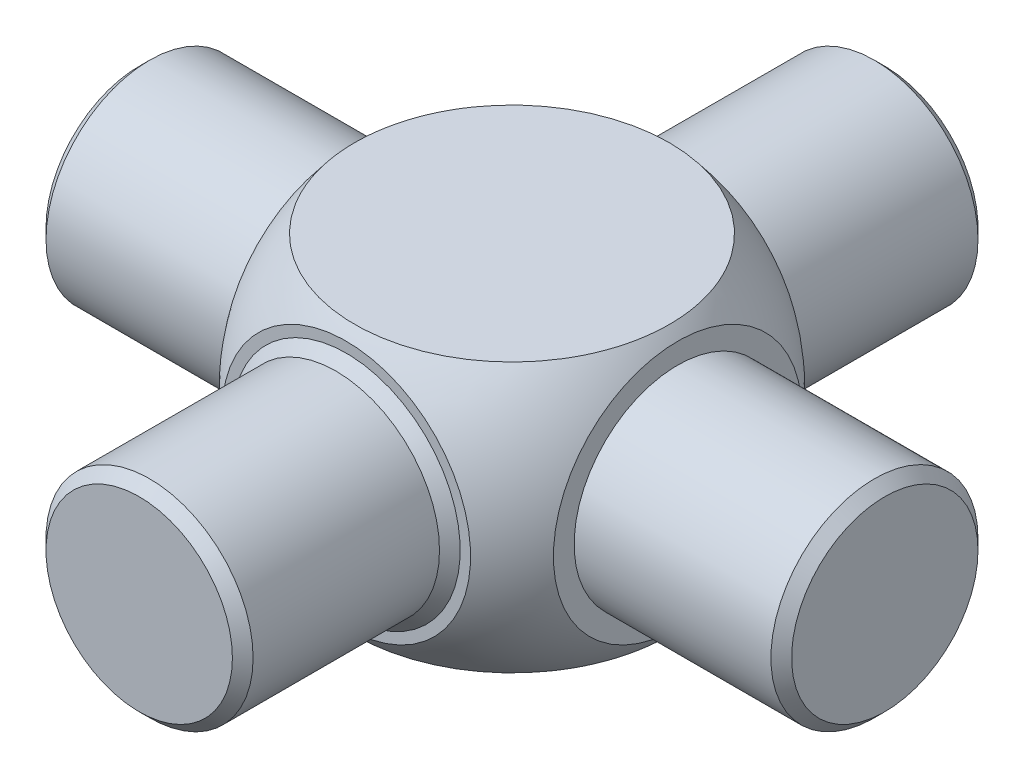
from build123d import *

# Parameters (mm, degrees)
ESQUISSE2_W             = 18
ESQUISSE2_H             = 4.5
ENL_V_MAT_EXTRU_1_DEPTH = 12.5
ESQUISSE3_W             = 18
ESQUISSE3_H             = 3
ENL_V_MAT_EXTRU_2_DEPTH = 12.5
ESQUISSE4_W             = 5
ESQUISSE4_H             = 36
CHANFREIN1_SIZE         = 0.5


with BuildPart() as part:
    # Esquisse1 → Base-R_volution (revolve)
    with BuildSketch(Plane.XY, mode=Mode.PRIVATE) as base_r_volution_sk:
        with BuildLine():
            Line((18, 0), (-18, 0))
            Line((-18, 0), (-18, 5))
            Line((-18, 5), (-8, 5))
            Line((-8, 5), (-8, 6))
            ThreePointArc((-8, 6), (0, 10), (8, 6))
            Line((8, 6), (8, 5))
            Line((8, 5), (18, 5))
            Line((18, 5), (18, 0))
        make_face()
    revolve(base_r_volution_sk.sketch.rotate(Axis((0, 0, 0), (-1, 0, 0)), 90), axis=Axis((0, 0, 0), (-1, 0, 0)))

    # Esquisse2 → Enl_v. mat.-Extru.1 (cut, symmetric)
    with BuildSketch(Plane.XY):
        with Locations((0, 8.75)):
            Rectangle(ESQUISSE2_W, ESQUISSE2_H)
        with Locations((0, -8.75)):
            Rectangle(ESQUISSE2_W, ESQUISSE2_H)
    extrude(amount=ENL_V_MAT_EXTRU_1_DEPTH, both=True, mode=Mode.SUBTRACT)

    # Esquisse3 → Enl_v. mat.-Extru.2 (cut, symmetric)
    with BuildSketch(Plane(origin=(0, 0, 0), x_dir=(1, 0, 0), z_dir=(0, 1, 0))):
        with Locations((0, 9.5)):
            Rectangle(ESQUISSE3_W, ESQUISSE3_H)
        with Locations((0, -9.5)):
            Rectangle(ESQUISSE3_W, ESQUISSE3_H)
    extrude(amount=ENL_V_MAT_EXTRU_2_DEPTH, both=True, mode=Mode.SUBTRACT)

    # Esquisse4 → Boss.-R_vol.1 (revolve)
    with BuildSketch(Plane(origin=(0, 0, 0), x_dir=(1, 0, 0), z_dir=(0, 1, 0))):
        with Locations((2.5, 0)):
            Rectangle(ESQUISSE4_W, ESQUISSE4_H)
    revolve(axis=Axis((0, 0, 0), (0, 0, -1)))

    # Chanfrein1
    chanfrein1_edges = [part.edges().sort_by_distance(p)[0] for p in [
        (-18, 0, 5),
        (-5, 0, 8),
        (-5, 0, -18),
        (18, 0, 5),
        (-5, 0, 18),
    ]]
    chamfer(chanfrein1_edges, length=CHANFREIN1_SIZE)


solid = part.part
